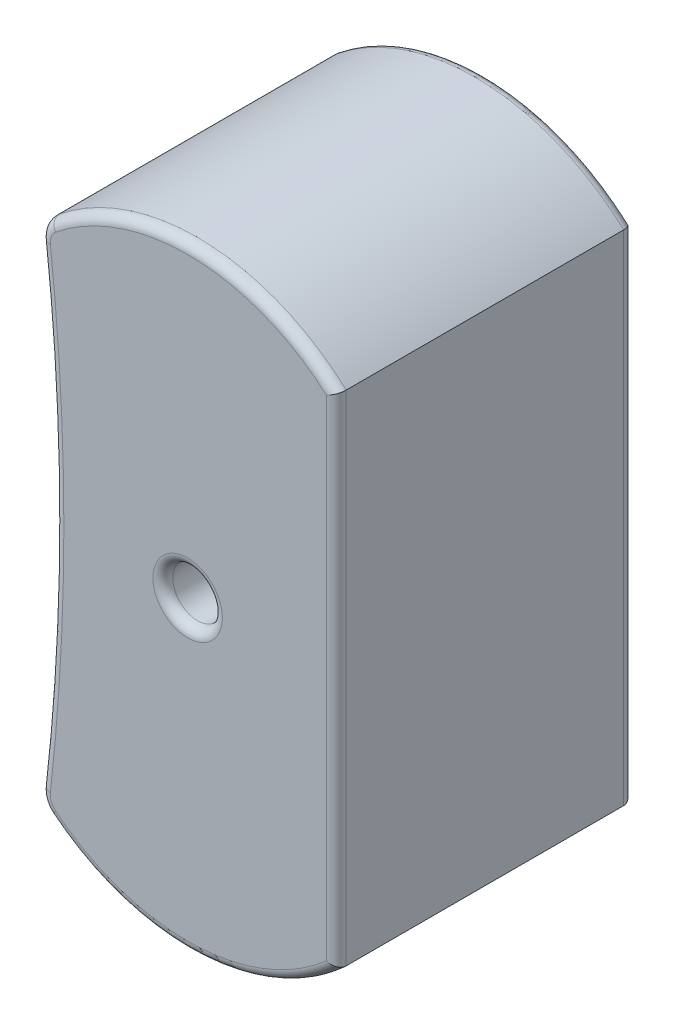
from build123d import *

# Parameters (mm, degrees)
ESQUISSE1_R      = 1
EXTRUSION1_DEPTH = 12
CONG_1_R         = 0.4
CONG_2_R         = 0.4


with BuildPart() as part:
    # Esquisse1 → Extrusion1 (new body)
    with BuildSketch(Plane.XY):
        with BuildLine():
            Line((12, 2.336546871), (12, 22.463453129))
            ThreePointArc((12, 22.463453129), (6.281628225, 24.795528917), (0.426798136, 22.831014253))
            ThreePointArc((0.426798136, 22.831014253), (0.129690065, 22.432207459), (0.061424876, 21.939602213))
            ThreePointArc((0.061424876, 21.939602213), (0.603809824, 12.4), (0.061424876, 2.860397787))
            ThreePointArc((0.061424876, 2.860397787), (0.129690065, 2.367792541), (0.426798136, 1.968985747))
            ThreePointArc((0.426798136, 1.968985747), (6.281628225, 0.004471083), (12, 2.336546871))
        make_face()
        with Locations((6, 12.4)):
            Circle(ESQUISSE1_R, mode=Mode.SUBTRACT)
    extrude(amount=EXTRUSION1_DEPTH)

    # Cong_1
    cong_1_edges = [part.edges().sort_by_distance(p)[0] for p in [
        (0.129690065, 2.367792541, 12),
        (6.281628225, 0.004471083, 12),
        (12, 12.4, 12),
        (5, 12.4, 12),
        (6.281628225, 24.795528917, 12),
        (0.129690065, 22.432207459, 12),
        (0.603809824, 12.4, 12),
    ]]
    fillet(cong_1_edges, radius=CONG_1_R)

    # Cong_2
    cong_2_edges = [part.edges().sort_by_distance(p)[0] for p in [
        (5, 12.4, 0),
        (6.281628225, 24.795528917, 0),
        (12, 12.4, 0),
        (6.281628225, 0.004471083, 0),
        (0.129690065, 2.367792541, 0),
        (0.603809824, 12.4, 0),
        (0.129690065, 22.432207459, 0),
    ]]
    fillet(cong_2_edges, radius=CONG_2_R)


solid = part.part
